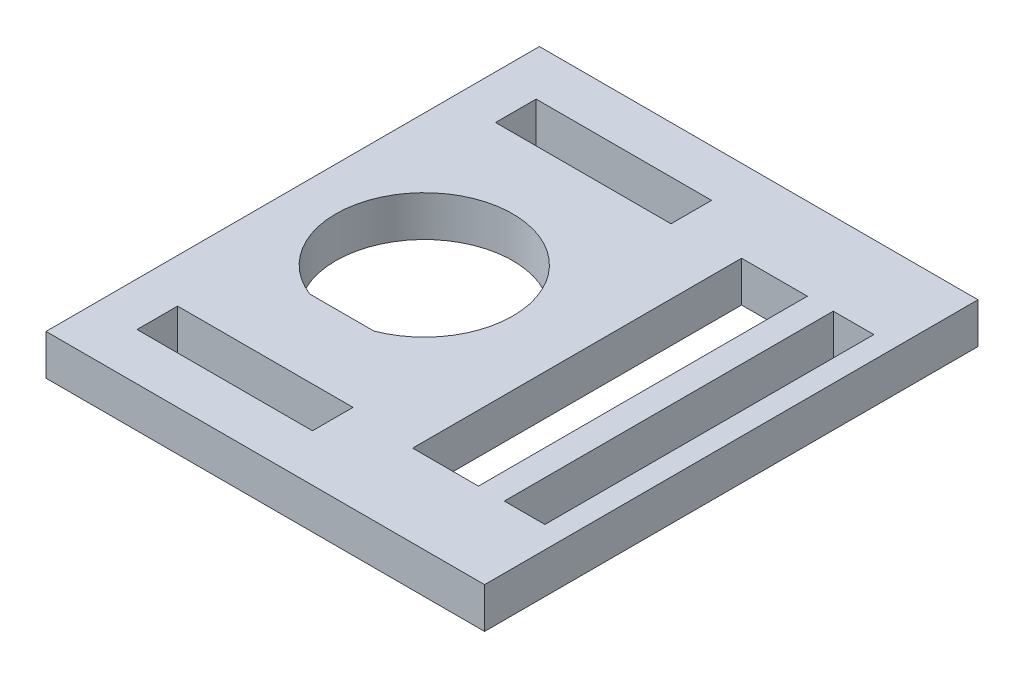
ISO-10303-21;
HEADER;
FILE_DESCRIPTION(('STEP AP214'),'2;1');
FILE_NAME('part.step','',(''),(''),'','','');
FILE_SCHEMA(('AUTOMOTIVE_DESIGN { 1 0 10303 214 1 1 1 1 }'));
ENDSEC;
DATA;
#1=APPLICATION_CONTEXT('core data for automotive mechanical design processes');
#2=APPLICATION_PROTOCOL_DEFINITION('international standard','automotive_design',2000,#1);
#3=PRODUCT_CONTEXT('',#1,'mechanical');
#4=PRODUCT('Part','Part','',(#3));
#5=PRODUCT_RELATED_PRODUCT_CATEGORY('part','',(#4));
#6=PRODUCT_DEFINITION_FORMATION('','',#4);
#7=PRODUCT_DEFINITION_CONTEXT('part definition',#1,'design');
#8=PRODUCT_DEFINITION('design','',#6,#7);
#9=PRODUCT_DEFINITION_SHAPE('','',#8);
#10=(LENGTH_UNIT() NAMED_UNIT(*) SI_UNIT(.MILLI.,.METRE.));
#11=(NAMED_UNIT(*) PLANE_ANGLE_UNIT() SI_UNIT($,.RADIAN.));
#12=(NAMED_UNIT(*) SI_UNIT($,.STERADIAN.) SOLID_ANGLE_UNIT());
#13=UNCERTAINTY_MEASURE_WITH_UNIT(LENGTH_MEASURE(1.E-05),#10,'distance_accuracy_value','');
#14=(GEOMETRIC_REPRESENTATION_CONTEXT(3) GLOBAL_UNCERTAINTY_ASSIGNED_CONTEXT((#13)) GLOBAL_UNIT_ASSIGNED_CONTEXT((#10,
#11,#12)) REPRESENTATION_CONTEXT('',''));
#15=CARTESIAN_POINT('',(0.,0.,0.));
#16=DIRECTION('',(0.,0.,1.));
#17=DIRECTION('',(1.,0.,0.));
#18=AXIS2_PLACEMENT_3D('',#15,#16,#17);
#19=CARTESIAN_POINT('',(0.,2.3495,0.));
#20=DIRECTION('',(0.,1.,0.));
#21=DIRECTION('',(0.,0.,1.));
#22=AXIS2_PLACEMENT_3D('',#19,#20,#21);
#23=PLANE('',#22);
#24=DIRECTION('',(0.,0.,-1.));
#25=VECTOR('',#24,1.);
#26=CARTESIAN_POINT('',(25.4,2.3495,-28.575));
#27=LINE('',#26,#25);
#28=CARTESIAN_POINT('',(25.4,2.3495,28.575));
#29=VERTEX_POINT('',#28);
#30=CARTESIAN_POINT('',(25.4,2.3495,-28.575));
#31=VERTEX_POINT('',#30);
#32=EDGE_CURVE('E329',#29,#31,#27,.T.);
#33=ORIENTED_EDGE('',*,*,#32,.T.);
#34=DIRECTION('',(-1.,0.,0.));
#35=VECTOR('',#34,1.);
#36=CARTESIAN_POINT('',(-25.4,2.3495,-28.575));
#37=LINE('',#36,#35);
#38=CARTESIAN_POINT('',(-25.4,2.3495,-28.575));
#39=VERTEX_POINT('',#38);
#40=EDGE_CURVE('E332',#31,#39,#37,.T.);
#41=ORIENTED_EDGE('',*,*,#40,.T.);
#42=DIRECTION('',(0.,0.,1.));
#43=VECTOR('',#42,1.);
#44=CARTESIAN_POINT('',(-25.4,2.3495,-28.575));
#45=LINE('',#44,#43);
#46=CARTESIAN_POINT('',(-25.4,2.3495,28.575));
#47=VERTEX_POINT('',#46);
#48=EDGE_CURVE('E335',#39,#47,#45,.T.);
#49=ORIENTED_EDGE('',*,*,#48,.T.);
#50=DIRECTION('',(1.,0.,0.));
#51=VECTOR('',#50,1.);
#52=CARTESIAN_POINT('',(-25.4,2.3495,28.575));
#53=LINE('',#52,#51);
#54=EDGE_CURVE('E337',#47,#29,#53,.T.);
#55=ORIENTED_EDGE('',*,*,#54,.T.);
#56=EDGE_LOOP('',(#33,#41,#49,#55));
#57=FACE_BOUND('',#56,.T.);
#58=CARTESIAN_POINT('',(-10.16,2.3495,0.));
#59=DIRECTION('',(0.,1.,0.));
#60=DIRECTION('',(0.,0.,1.));
#61=AXIS2_PLACEMENT_3D('',#58,#59,#60);
#62=CIRCLE('',#61,10.25);
#63=CARTESIAN_POINT('',(-6.43709790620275,2.3495,9.55));
#64=VERTEX_POINT('',#63);
#65=CARTESIAN_POINT('',(-13.8829020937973,2.3495,9.55));
#66=VERTEX_POINT('',#65);
#67=EDGE_CURVE('E306',#64,#66,#62,.T.);
#68=ORIENTED_EDGE('',*,*,#67,.F.);
#69=DIRECTION('',(1.,0.,0.));
#70=VECTOR('',#69,1.);
#71=CARTESIAN_POINT('',(-13.8829020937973,2.3495,9.55));
#72=LINE('',#71,#70);
#73=EDGE_CURVE('E317',#66,#64,#72,.T.);
#74=ORIENTED_EDGE('',*,*,#73,.F.);
#75=EDGE_LOOP('',(#68,#74));
#76=FACE_BOUND('',#75,.T.);
#77=DIRECTION('',(0.,0.,-1.));
#78=VECTOR('',#77,1.);
#79=CARTESIAN_POINT('',(18.161,2.3495,19.05));
#80=LINE('',#79,#78);
#81=CARTESIAN_POINT('',(18.161,2.3495,19.05));
#82=VERTEX_POINT('',#81);
#83=CARTESIAN_POINT('',(18.161,2.3495,-19.05));
#84=VERTEX_POINT('',#83);
#85=EDGE_CURVE('E281',#82,#84,#80,.T.);
#86=ORIENTED_EDGE('',*,*,#85,.T.);
#87=DIRECTION('',(1.,0.,0.));
#88=VECTOR('',#87,1.);
#89=CARTESIAN_POINT('',(22.86,2.3495,-19.05));
#90=LINE('',#89,#88);
#91=CARTESIAN_POINT('',(22.86,2.3495,-19.05));
#92=VERTEX_POINT('',#91);
#93=EDGE_CURVE('E284',#84,#92,#90,.T.);
#94=ORIENTED_EDGE('',*,*,#93,.T.);
#95=DIRECTION('',(0.,0.,1.));
#96=VECTOR('',#95,1.);
#97=CARTESIAN_POINT('',(22.86,2.3495,19.05));
#98=LINE('',#97,#96);
#99=CARTESIAN_POINT('',(22.86,2.3495,19.05));
#100=VERTEX_POINT('',#99);
#101=EDGE_CURVE('E288',#92,#100,#98,.T.);
#102=ORIENTED_EDGE('',*,*,#101,.T.);
#103=DIRECTION('',(-1.,0.,0.));
#104=VECTOR('',#103,1.);
#105=CARTESIAN_POINT('',(22.86,2.3495,19.05));
#106=LINE('',#105,#104);
#107=EDGE_CURVE('E291',#100,#82,#106,.T.);
#108=ORIENTED_EDGE('',*,*,#107,.T.);
#109=EDGE_LOOP('',(#86,#94,#102,#108));
#110=FACE_BOUND('',#109,.T.);
#111=DIRECTION('',(0.,0.,-1.));
#112=VECTOR('',#111,1.);
#113=CARTESIAN_POINT('',(15.161,2.3495,-19.05));
#114=LINE('',#113,#112);
#115=CARTESIAN_POINT('',(15.161,2.3495,19.05));
#116=VERTEX_POINT('',#115);
#117=CARTESIAN_POINT('',(15.161,2.3495,-19.05));
#118=VERTEX_POINT('',#117);
#119=EDGE_CURVE('E242',#116,#118,#114,.T.);
#120=ORIENTED_EDGE('',*,*,#119,.F.);
#121=DIRECTION('',(1.,0.,0.));
#122=VECTOR('',#121,1.);
#123=CARTESIAN_POINT('',(7.541,2.3495,19.05));
#124=LINE('',#123,#122);
#125=CARTESIAN_POINT('',(7.541,2.3495,19.05));
#126=VERTEX_POINT('',#125);
#127=EDGE_CURVE('E253',#126,#116,#124,.T.);
#128=ORIENTED_EDGE('',*,*,#127,.F.);
#129=DIRECTION('',(0.,0.,1.));
#130=VECTOR('',#129,1.);
#131=CARTESIAN_POINT('',(7.541,2.3495,-19.05));
#132=LINE('',#131,#130);
#133=CARTESIAN_POINT('',(7.541,2.3495,-19.05));
#134=VERTEX_POINT('',#133);
#135=EDGE_CURVE('E267',#134,#126,#132,.T.);
#136=ORIENTED_EDGE('',*,*,#135,.F.);
#137=DIRECTION('',(-1.,0.,0.));
#138=VECTOR('',#137,1.);
#139=CARTESIAN_POINT('',(7.541,2.3495,-19.05));
#140=LINE('',#139,#138);
#141=EDGE_CURVE('E264',#118,#134,#140,.T.);
#142=ORIENTED_EDGE('',*,*,#141,.F.);
#143=EDGE_LOOP('',(#120,#128,#136,#142));
#144=FACE_BOUND('',#143,.T.);
#145=DIRECTION('',(0.,0.,1.));
#146=VECTOR('',#145,1.);
#147=CARTESIAN_POINT('',(-20.32,2.3495,-23.114));
#148=LINE('',#147,#146);
#149=CARTESIAN_POINT('',(-20.32,2.3495,-23.114));
#150=VERTEX_POINT('',#149);
#151=CARTESIAN_POINT('',(-20.32,2.3495,-18.415));
#152=VERTEX_POINT('',#151);
#153=EDGE_CURVE('E213',#150,#152,#148,.T.);
#154=ORIENTED_EDGE('',*,*,#153,.F.);
#155=DIRECTION('',(-1.,0.,0.));
#156=VECTOR('',#155,1.);
#157=CARTESIAN_POINT('',(0.,2.3495,-23.114));
#158=LINE('',#157,#156);
#159=CARTESIAN_POINT('',(0.,2.3495,-23.114));
#160=VERTEX_POINT('',#159);
#161=EDGE_CURVE('E221',#160,#150,#158,.T.);
#162=ORIENTED_EDGE('',*,*,#161,.F.);
#163=DIRECTION('',(0.,0.,-1.));
#164=VECTOR('',#163,1.);
#165=CARTESIAN_POINT('',(0.,2.3495,-18.415));
#166=LINE('',#165,#164);
#167=CARTESIAN_POINT('',(0.,2.3495,-18.415));
#168=VERTEX_POINT('',#167);
#169=EDGE_CURVE('E235',#168,#160,#166,.T.);
#170=ORIENTED_EDGE('',*,*,#169,.F.);
#171=DIRECTION('',(1.,0.,0.));
#172=VECTOR('',#171,1.);
#173=CARTESIAN_POINT('',(-20.32,2.3495,-18.415));
#174=LINE('',#173,#172);
#175=EDGE_CURVE('E232',#152,#168,#174,.T.);
#176=ORIENTED_EDGE('',*,*,#175,.F.);
#177=EDGE_LOOP('',(#154,#162,#170,#176));
#178=FACE_BOUND('',#177,.T.);
#179=DIRECTION('',(-1.,0.,0.));
#180=VECTOR('',#179,1.);
#181=CARTESIAN_POINT('',(0.,2.3495,23.114));
#182=LINE('',#181,#180);
#183=CARTESIAN_POINT('',(0.,2.3495,23.114));
#184=VERTEX_POINT('',#183);
#185=CARTESIAN_POINT('',(-20.32,2.3495,23.114));
#186=VERTEX_POINT('',#185);
#187=EDGE_CURVE('E207',#184,#186,#182,.T.);
#188=ORIENTED_EDGE('',*,*,#187,.T.);
#189=DIRECTION('',(0.,0.,-1.));
#190=VECTOR('',#189,1.);
#191=CARTESIAN_POINT('',(-20.32,2.3495,23.114));
#192=LINE('',#191,#190);
#193=CARTESIAN_POINT('',(-20.32,2.3495,18.415));
#194=VERTEX_POINT('',#193);
#195=EDGE_CURVE('E48',#186,#194,#192,.T.);
#196=ORIENTED_EDGE('',*,*,#195,.T.);
#197=DIRECTION('',(1.,0.,0.));
#198=VECTOR('',#197,1.);
#199=CARTESIAN_POINT('',(-20.32,2.3495,18.415));
#200=LINE('',#199,#198);
#201=CARTESIAN_POINT('',(0.,2.3495,18.415));
#202=VERTEX_POINT('',#201);
#203=EDGE_CURVE('E198',#194,#202,#200,.T.);
#204=ORIENTED_EDGE('',*,*,#203,.T.);
#205=DIRECTION('',(0.,0.,1.));
#206=VECTOR('',#205,1.);
#207=CARTESIAN_POINT('',(0.,2.3495,18.415));
#208=LINE('',#207,#206);
#209=EDGE_CURVE('E201',#202,#184,#208,.T.);
#210=ORIENTED_EDGE('',*,*,#209,.T.);
#211=EDGE_LOOP('',(#188,#196,#204,#210));
#212=FACE_BOUND('',#211,.T.);
#213=ADVANCED_FACE('F33',(#57,#76,#110,#144,#178,#212),#23,.T.);
#214=CARTESIAN_POINT('',(0.,-2.3495,0.));
#215=DIRECTION('',(0.,1.,0.));
#216=DIRECTION('',(0.,0.,1.));
#217=AXIS2_PLACEMENT_3D('',#214,#215,#216);
#218=PLANE('',#217);
#219=DIRECTION('',(0.,0.,-1.));
#220=VECTOR('',#219,1.);
#221=CARTESIAN_POINT('',(25.4,-2.3495,-28.575));
#222=LINE('',#221,#220);
#223=CARTESIAN_POINT('',(25.4,-2.3495,28.575));
#224=VERTEX_POINT('',#223);
#225=CARTESIAN_POINT('',(25.4,-2.3495,-28.575));
#226=VERTEX_POINT('',#225);
#227=EDGE_CURVE('E326',#224,#226,#222,.T.);
#228=ORIENTED_EDGE('',*,*,#227,.F.);
#229=DIRECTION('',(1.,0.,0.));
#230=VECTOR('',#229,1.);
#231=CARTESIAN_POINT('',(-25.4,-2.3495,28.575));
#232=LINE('',#231,#230);
#233=CARTESIAN_POINT('',(-25.4,-2.3495,28.575));
#234=VERTEX_POINT('',#233);
#235=EDGE_CURVE('E333',#234,#224,#232,.T.);
#236=ORIENTED_EDGE('',*,*,#235,.F.);
#237=DIRECTION('',(0.,0.,1.));
#238=VECTOR('',#237,1.);
#239=CARTESIAN_POINT('',(-25.4,-2.3495,-28.575));
#240=LINE('',#239,#238);
#241=CARTESIAN_POINT('',(-25.4,-2.3495,-28.575));
#242=VERTEX_POINT('',#241);
#243=EDGE_CURVE('E344',#242,#234,#240,.T.);
#244=ORIENTED_EDGE('',*,*,#243,.F.);
#245=DIRECTION('',(-1.,0.,0.));
#246=VECTOR('',#245,1.);
#247=CARTESIAN_POINT('',(-25.4,-2.3495,-28.575));
#248=LINE('',#247,#246);
#249=EDGE_CURVE('E342',#226,#242,#248,.T.);
#250=ORIENTED_EDGE('',*,*,#249,.F.);
#251=EDGE_LOOP('',(#228,#236,#244,#250));
#252=FACE_BOUND('',#251,.T.);
#253=DIRECTION('',(1.,0.,0.));
#254=VECTOR('',#253,1.);
#255=CARTESIAN_POINT('',(-13.8829020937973,-2.3495,9.55));
#256=LINE('',#255,#254);
#257=CARTESIAN_POINT('',(-13.8829020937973,-2.3495,9.55));
#258=VERTEX_POINT('',#257);
#259=CARTESIAN_POINT('',(-6.43709790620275,-2.3495,9.55));
#260=VERTEX_POINT('',#259);
#261=EDGE_CURVE('E316',#258,#260,#256,.T.);
#262=ORIENTED_EDGE('',*,*,#261,.T.);
#263=CARTESIAN_POINT('',(-10.16,-2.3495,0.));
#264=DIRECTION('',(0.,1.,0.));
#265=DIRECTION('',(0.,0.,1.));
#266=AXIS2_PLACEMENT_3D('',#263,#264,#265);
#267=CIRCLE('',#266,10.25);
#268=EDGE_CURVE('E313',#260,#258,#267,.T.);
#269=ORIENTED_EDGE('',*,*,#268,.T.);
#270=EDGE_LOOP('',(#262,#269));
#271=FACE_BOUND('',#270,.T.);
#272=DIRECTION('',(1.,0.,0.));
#273=VECTOR('',#272,1.);
#274=CARTESIAN_POINT('',(22.86,-2.3495,-19.05));
#275=LINE('',#274,#273);
#276=CARTESIAN_POINT('',(18.161,-2.3495,-19.05));
#277=VERTEX_POINT('',#276);
#278=CARTESIAN_POINT('',(22.86,-2.3495,-19.05));
#279=VERTEX_POINT('',#278);
#280=EDGE_CURVE('E296',#277,#279,#275,.T.);
#281=ORIENTED_EDGE('',*,*,#280,.F.);
#282=DIRECTION('',(0.,0.,-1.));
#283=VECTOR('',#282,1.);
#284=CARTESIAN_POINT('',(18.161,-2.3495,19.05));
#285=LINE('',#284,#283);
#286=CARTESIAN_POINT('',(18.161,-2.3495,19.05));
#287=VERTEX_POINT('',#286);
#288=EDGE_CURVE('E274',#287,#277,#285,.T.);
#289=ORIENTED_EDGE('',*,*,#288,.F.);
#290=DIRECTION('',(-1.,0.,0.));
#291=VECTOR('',#290,1.);
#292=CARTESIAN_POINT('',(22.86,-2.3495,19.05));
#293=LINE('',#292,#291);
#294=CARTESIAN_POINT('',(22.86,-2.3495,19.05));
#295=VERTEX_POINT('',#294);
#296=EDGE_CURVE('E285',#295,#287,#293,.T.);
#297=ORIENTED_EDGE('',*,*,#296,.F.);
#298=DIRECTION('',(0.,0.,1.));
#299=VECTOR('',#298,1.);
#300=CARTESIAN_POINT('',(22.86,-2.3495,19.05));
#301=LINE('',#300,#299);
#302=EDGE_CURVE('E299',#279,#295,#301,.T.);
#303=ORIENTED_EDGE('',*,*,#302,.F.);
#304=EDGE_LOOP('',(#281,#289,#297,#303));
#305=FACE_BOUND('',#304,.T.);
#306=DIRECTION('',(1.,0.,0.));
#307=VECTOR('',#306,1.);
#308=CARTESIAN_POINT('',(7.541,-2.3495,19.05));
#309=LINE('',#308,#307);
#310=CARTESIAN_POINT('',(7.541,-2.3495,19.05));
#311=VERTEX_POINT('',#310);
#312=CARTESIAN_POINT('',(15.161,-2.3495,19.05));
#313=VERTEX_POINT('',#312);
#314=EDGE_CURVE('E259',#311,#313,#309,.T.);
#315=ORIENTED_EDGE('',*,*,#314,.T.);
#316=DIRECTION('',(0.,0.,-1.));
#317=VECTOR('',#316,1.);
#318=CARTESIAN_POINT('',(15.161,-2.3495,-19.05));
#319=LINE('',#318,#317);
#320=CARTESIAN_POINT('',(15.161,-2.3495,-19.05));
#321=VERTEX_POINT('',#320);
#322=EDGE_CURVE('E249',#313,#321,#319,.T.);
#323=ORIENTED_EDGE('',*,*,#322,.T.);
#324=DIRECTION('',(-1.,0.,0.));
#325=VECTOR('',#324,1.);
#326=CARTESIAN_POINT('',(7.541,-2.3495,-19.05));
#327=LINE('',#326,#325);
#328=CARTESIAN_POINT('',(7.541,-2.3495,-19.05));
#329=VERTEX_POINT('',#328);
#330=EDGE_CURVE('E252',#321,#329,#327,.T.);
#331=ORIENTED_EDGE('',*,*,#330,.T.);
#332=DIRECTION('',(0.,0.,1.));
#333=VECTOR('',#332,1.);
#334=CARTESIAN_POINT('',(7.541,-2.3495,-19.05));
#335=LINE('',#334,#333);
#336=EDGE_CURVE('E256',#329,#311,#335,.T.);
#337=ORIENTED_EDGE('',*,*,#336,.T.);
#338=EDGE_LOOP('',(#315,#323,#331,#337));
#339=FACE_BOUND('',#338,.T.);
#340=DIRECTION('',(-1.,0.,0.));
#341=VECTOR('',#340,1.);
#342=CARTESIAN_POINT('',(0.,-2.3495,-23.114));
#343=LINE('',#342,#341);
#344=CARTESIAN_POINT('',(0.,-2.3495,-23.114));
#345=VERTEX_POINT('',#344);
#346=CARTESIAN_POINT('',(-20.32,-2.3495,-23.114));
#347=VERTEX_POINT('',#346);
#348=EDGE_CURVE('E227',#345,#347,#343,.T.);
#349=ORIENTED_EDGE('',*,*,#348,.T.);
#350=DIRECTION('',(0.,0.,1.));
#351=VECTOR('',#350,1.);
#352=CARTESIAN_POINT('',(-20.32,-2.3495,-23.114));
#353=LINE('',#352,#351);
#354=CARTESIAN_POINT('',(-20.32,-2.3495,-18.415));
#355=VERTEX_POINT('',#354);
#356=EDGE_CURVE('E217',#347,#355,#353,.T.);
#357=ORIENTED_EDGE('',*,*,#356,.T.);
#358=DIRECTION('',(1.,0.,0.));
#359=VECTOR('',#358,1.);
#360=CARTESIAN_POINT('',(-20.32,-2.3495,-18.415));
#361=LINE('',#360,#359);
#362=CARTESIAN_POINT('',(0.,-2.3495,-18.415));
#363=VERTEX_POINT('',#362);
#364=EDGE_CURVE('E220',#355,#363,#361,.T.);
#365=ORIENTED_EDGE('',*,*,#364,.T.);
#366=DIRECTION('',(0.,0.,-1.));
#367=VECTOR('',#366,1.);
#368=CARTESIAN_POINT('',(0.,-2.3495,-18.415));
#369=LINE('',#368,#367);
#370=EDGE_CURVE('E224',#363,#345,#369,.T.);
#371=ORIENTED_EDGE('',*,*,#370,.T.);
#372=EDGE_LOOP('',(#349,#357,#365,#371));
#373=FACE_BOUND('',#372,.T.);
#374=DIRECTION('',(0.,0.,-1.));
#375=VECTOR('',#374,1.);
#376=CARTESIAN_POINT('',(-20.32,-2.3495,23.114));
#377=LINE('',#376,#375);
#378=CARTESIAN_POINT('',(-20.32,-2.3495,23.114));
#379=VERTEX_POINT('',#378);
#380=CARTESIAN_POINT('',(-20.32,-2.3495,18.415));
#381=VERTEX_POINT('',#380);
#382=EDGE_CURVE('E190',#379,#381,#377,.T.);
#383=ORIENTED_EDGE('',*,*,#382,.F.);
#384=DIRECTION('',(-1.,0.,0.));
#385=VECTOR('',#384,1.);
#386=CARTESIAN_POINT('',(0.,-2.3495,23.114));
#387=LINE('',#386,#385);
#388=CARTESIAN_POINT('',(0.,-2.3495,23.114));
#389=VERTEX_POINT('',#388);
#390=EDGE_CURVE('E182',#389,#379,#387,.T.);
#391=ORIENTED_EDGE('',*,*,#390,.F.);
#392=DIRECTION('',(0.,0.,1.));
#393=VECTOR('',#392,1.);
#394=CARTESIAN_POINT('',(0.,-2.3495,18.415));
#395=LINE('',#394,#393);
#396=CARTESIAN_POINT('',(0.,-2.3495,18.415));
#397=VERTEX_POINT('',#396);
#398=EDGE_CURVE('E189',#397,#389,#395,.T.);
#399=ORIENTED_EDGE('',*,*,#398,.F.);
#400=DIRECTION('',(1.,0.,0.));
#401=VECTOR('',#400,1.);
#402=CARTESIAN_POINT('',(-20.32,-2.3495,18.415));
#403=LINE('',#402,#401);
#404=EDGE_CURVE('E194',#381,#397,#403,.T.);
#405=ORIENTED_EDGE('',*,*,#404,.F.);
#406=EDGE_LOOP('',(#383,#391,#399,#405));
#407=FACE_BOUND('',#406,.T.);
#408=ADVANCED_FACE('F197',(#252,#271,#305,#339,#373,#407),#218,.F.);
#409=CARTESIAN_POINT('',(25.4,2.3495,-28.575));
#410=DIRECTION('',(-1.,0.,0.));
#411=DIRECTION('',(0.,0.,1.));
#412=AXIS2_PLACEMENT_3D('',#409,#410,#411);
#413=PLANE('',#412);
#414=ORIENTED_EDGE('',*,*,#227,.T.);
#415=DIRECTION('',(0.,-1.,0.));
#416=VECTOR('',#415,1.);
#417=CARTESIAN_POINT('',(25.4,2.3495,-28.575));
#418=LINE('',#417,#416);
#419=EDGE_CURVE('E11',#31,#226,#418,.T.);
#420=ORIENTED_EDGE('',*,*,#419,.F.);
#421=ORIENTED_EDGE('',*,*,#32,.F.);
#422=DIRECTION('',(0.,-1.,0.));
#423=VECTOR('',#422,1.);
#424=CARTESIAN_POINT('',(25.4,2.3495,28.575));
#425=LINE('',#424,#423);
#426=EDGE_CURVE('E339',#29,#224,#425,.T.);
#427=ORIENTED_EDGE('',*,*,#426,.T.);
#428=EDGE_LOOP('',(#414,#420,#421,#427));
#429=FACE_BOUND('',#428,.T.);
#430=ADVANCED_FACE('F35',(#429),#413,.F.);
#431=CARTESIAN_POINT('',(-25.4,2.3495,-28.575));
#432=DIRECTION('',(0.,0.,1.));
#433=DIRECTION('',(1.,0.,0.));
#434=AXIS2_PLACEMENT_3D('',#431,#432,#433);
#435=PLANE('',#434);
#436=ORIENTED_EDGE('',*,*,#249,.T.);
#437=DIRECTION('',(0.,-1.,0.));
#438=VECTOR('',#437,1.);
#439=CARTESIAN_POINT('',(-25.4,2.3495,-28.575));
#440=LINE('',#439,#438);
#441=EDGE_CURVE('E41',#39,#242,#440,.T.);
#442=ORIENTED_EDGE('',*,*,#441,.F.);
#443=ORIENTED_EDGE('',*,*,#40,.F.);
#444=ORIENTED_EDGE('',*,*,#419,.T.);
#445=EDGE_LOOP('',(#436,#442,#443,#444));
#446=FACE_BOUND('',#445,.T.);
#447=ADVANCED_FACE('F372',(#446),#435,.F.);
#448=CARTESIAN_POINT('',(-25.4,2.3495,-28.575));
#449=DIRECTION('',(1.,0.,0.));
#450=DIRECTION('',(0.,0.,-1.));
#451=AXIS2_PLACEMENT_3D('',#448,#449,#450);
#452=PLANE('',#451);
#453=ORIENTED_EDGE('',*,*,#243,.T.);
#454=DIRECTION('',(0.,-1.,0.));
#455=VECTOR('',#454,1.);
#456=CARTESIAN_POINT('',(-25.4,2.3495,28.575));
#457=LINE('',#456,#455);
#458=EDGE_CURVE('E349',#47,#234,#457,.T.);
#459=ORIENTED_EDGE('',*,*,#458,.F.);
#460=ORIENTED_EDGE('',*,*,#48,.F.);
#461=ORIENTED_EDGE('',*,*,#441,.T.);
#462=EDGE_LOOP('',(#453,#459,#460,#461));
#463=FACE_BOUND('',#462,.T.);
#464=ADVANCED_FACE('F356',(#463),#452,.F.);
#465=CARTESIAN_POINT('',(-25.4,2.3495,28.575));
#466=DIRECTION('',(0.,0.,-1.));
#467=DIRECTION('',(-1.,0.,0.));
#468=AXIS2_PLACEMENT_3D('',#465,#466,#467);
#469=PLANE('',#468);
#470=ORIENTED_EDGE('',*,*,#235,.T.);
#471=ORIENTED_EDGE('',*,*,#426,.F.);
#472=ORIENTED_EDGE('',*,*,#54,.F.);
#473=ORIENTED_EDGE('',*,*,#458,.T.);
#474=EDGE_LOOP('',(#470,#471,#472,#473));
#475=FACE_BOUND('',#474,.T.);
#476=ADVANCED_FACE('F365',(#475),#469,.F.);
#477=CARTESIAN_POINT('',(-10.16,-2.3495,0.));
#478=DIRECTION('',(0.,1.,0.));
#479=DIRECTION('',(0.,0.,1.));
#480=AXIS2_PLACEMENT_3D('',#477,#478,#479);
#481=CYLINDRICAL_SURFACE('',#480,10.25);
#482=ORIENTED_EDGE('',*,*,#67,.T.);
#483=DIRECTION('',(0.,1.,0.));
#484=VECTOR('',#483,1.);
#485=CARTESIAN_POINT('',(-13.8829020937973,-2.3495,9.55));
#486=LINE('',#485,#484);
#487=EDGE_CURVE('E320',#258,#66,#486,.T.);
#488=ORIENTED_EDGE('',*,*,#487,.F.);
#489=ORIENTED_EDGE('',*,*,#268,.F.);
#490=DIRECTION('',(0.,1.,0.));
#491=VECTOR('',#490,1.);
#492=CARTESIAN_POINT('',(-6.43709790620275,-2.3495,9.55));
#493=LINE('',#492,#491);
#494=EDGE_CURVE('E324',#260,#64,#493,.T.);
#495=ORIENTED_EDGE('',*,*,#494,.T.);
#496=EDGE_LOOP('',(#482,#488,#489,#495));
#497=FACE_BOUND('',#496,.T.);
#498=ADVANCED_FACE('F386',(#497),#481,.F.);
#499=CARTESIAN_POINT('',(-13.8829020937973,-2.3495,9.55));
#500=DIRECTION('',(0.,0.,1.));
#501=DIRECTION('',(1.,0.,0.));
#502=AXIS2_PLACEMENT_3D('',#499,#500,#501);
#503=PLANE('',#502);
#504=ORIENTED_EDGE('',*,*,#73,.T.);
#505=ORIENTED_EDGE('',*,*,#494,.F.);
#506=ORIENTED_EDGE('',*,*,#261,.F.);
#507=ORIENTED_EDGE('',*,*,#487,.T.);
#508=EDGE_LOOP('',(#504,#505,#506,#507));
#509=FACE_BOUND('',#508,.T.);
#510=ADVANCED_FACE('F393',(#509),#503,.F.);
#511=CARTESIAN_POINT('',(18.161,2.3495,19.05));
#512=DIRECTION('',(-1.,0.,0.));
#513=DIRECTION('',(0.,0.,1.));
#514=AXIS2_PLACEMENT_3D('',#511,#512,#513);
#515=PLANE('',#514);
#516=ORIENTED_EDGE('',*,*,#288,.T.);
#517=DIRECTION('',(0.,-1.,0.));
#518=VECTOR('',#517,1.);
#519=CARTESIAN_POINT('',(18.161,2.3495,-19.05));
#520=LINE('',#519,#518);
#521=EDGE_CURVE('E294',#84,#277,#520,.T.);
#522=ORIENTED_EDGE('',*,*,#521,.F.);
#523=ORIENTED_EDGE('',*,*,#85,.F.);
#524=DIRECTION('',(0.,-1.,0.));
#525=VECTOR('',#524,1.);
#526=CARTESIAN_POINT('',(18.161,2.3495,19.05));
#527=LINE('',#526,#525);
#528=EDGE_CURVE('E304',#82,#287,#527,.T.);
#529=ORIENTED_EDGE('',*,*,#528,.T.);
#530=EDGE_LOOP('',(#516,#522,#523,#529));
#531=FACE_BOUND('',#530,.T.);
#532=ADVANCED_FACE('F398',(#531),#515,.F.);
#533=CARTESIAN_POINT('',(22.86,2.3495,19.05));
#534=DIRECTION('',(0.,0.,1.));
#535=DIRECTION('',(1.,0.,0.));
#536=AXIS2_PLACEMENT_3D('',#533,#534,#535);
#537=PLANE('',#536);
#538=ORIENTED_EDGE('',*,*,#296,.T.);
#539=ORIENTED_EDGE('',*,*,#528,.F.);
#540=ORIENTED_EDGE('',*,*,#107,.F.);
#541=DIRECTION('',(0.,-1.,0.));
#542=VECTOR('',#541,1.);
#543=CARTESIAN_POINT('',(22.86,2.3495,19.05));
#544=LINE('',#543,#542);
#545=EDGE_CURVE('E307',#100,#295,#544,.T.);
#546=ORIENTED_EDGE('',*,*,#545,.T.);
#547=EDGE_LOOP('',(#538,#539,#540,#546));
#548=FACE_BOUND('',#547,.T.);
#549=ADVANCED_FACE('F465',(#548),#537,.F.);
#550=CARTESIAN_POINT('',(22.86,2.3495,19.05));
#551=DIRECTION('',(1.,0.,0.));
#552=DIRECTION('',(0.,0.,-1.));
#553=AXIS2_PLACEMENT_3D('',#550,#551,#552);
#554=PLANE('',#553);
#555=ORIENTED_EDGE('',*,*,#302,.T.);
#556=ORIENTED_EDGE('',*,*,#545,.F.);
#557=ORIENTED_EDGE('',*,*,#101,.F.);
#558=DIRECTION('',(0.,-1.,0.));
#559=VECTOR('',#558,1.);
#560=CARTESIAN_POINT('',(22.86,2.3495,-19.05));
#561=LINE('',#560,#559);
#562=EDGE_CURVE('E309',#92,#279,#561,.T.);
#563=ORIENTED_EDGE('',*,*,#562,.T.);
#564=EDGE_LOOP('',(#555,#556,#557,#563));
#565=FACE_BOUND('',#564,.T.);
#566=ADVANCED_FACE('F468',(#565),#554,.F.);
#567=CARTESIAN_POINT('',(22.86,2.3495,-19.05));
#568=DIRECTION('',(0.,0.,-1.));
#569=DIRECTION('',(-1.,0.,0.));
#570=AXIS2_PLACEMENT_3D('',#567,#568,#569);
#571=PLANE('',#570);
#572=ORIENTED_EDGE('',*,*,#280,.T.);
#573=ORIENTED_EDGE('',*,*,#562,.F.);
#574=ORIENTED_EDGE('',*,*,#93,.F.);
#575=ORIENTED_EDGE('',*,*,#521,.T.);
#576=EDGE_LOOP('',(#572,#573,#574,#575));
#577=FACE_BOUND('',#576,.T.);
#578=ADVANCED_FACE('F463',(#577),#571,.F.);
#579=CARTESIAN_POINT('',(15.161,-2.3495,-19.05));
#580=DIRECTION('',(1.,0.,0.));
#581=DIRECTION('',(0.,0.,-1.));
#582=AXIS2_PLACEMENT_3D('',#579,#580,#581);
#583=PLANE('',#582);
#584=ORIENTED_EDGE('',*,*,#119,.T.);
#585=DIRECTION('',(0.,1.,0.));
#586=VECTOR('',#585,1.);
#587=CARTESIAN_POINT('',(15.161,-2.3495,-19.05));
#588=LINE('',#587,#586);
#589=EDGE_CURVE('E262',#321,#118,#588,.T.);
#590=ORIENTED_EDGE('',*,*,#589,.F.);
#591=ORIENTED_EDGE('',*,*,#322,.F.);
#592=DIRECTION('',(0.,1.,0.));
#593=VECTOR('',#592,1.);
#594=CARTESIAN_POINT('',(15.161,-2.3495,19.05));
#595=LINE('',#594,#593);
#596=EDGE_CURVE('E272',#313,#116,#595,.T.);
#597=ORIENTED_EDGE('',*,*,#596,.T.);
#598=EDGE_LOOP('',(#584,#590,#591,#597));
#599=FACE_BOUND('',#598,.T.);
#600=ADVANCED_FACE('F453',(#599),#583,.F.);
#601=CARTESIAN_POINT('',(7.541,-2.3495,19.05));
#602=DIRECTION('',(0.,0.,1.));
#603=DIRECTION('',(1.,0.,0.));
#604=AXIS2_PLACEMENT_3D('',#601,#602,#603);
#605=PLANE('',#604);
#606=ORIENTED_EDGE('',*,*,#127,.T.);
#607=ORIENTED_EDGE('',*,*,#596,.F.);
#608=ORIENTED_EDGE('',*,*,#314,.F.);
#609=DIRECTION('',(0.,1.,0.));
#610=VECTOR('',#609,1.);
#611=CARTESIAN_POINT('',(7.541,-2.3495,19.05));
#612=LINE('',#611,#610);
#613=EDGE_CURVE('E275',#311,#126,#612,.T.);
#614=ORIENTED_EDGE('',*,*,#613,.T.);
#615=EDGE_LOOP('',(#606,#607,#608,#614));
#616=FACE_BOUND('',#615,.T.);
#617=ADVANCED_FACE('F449',(#616),#605,.F.);
#618=CARTESIAN_POINT('',(7.541,-2.3495,-19.05));
#619=DIRECTION('',(-1.,0.,0.));
#620=DIRECTION('',(0.,0.,1.));
#621=AXIS2_PLACEMENT_3D('',#618,#619,#620);
#622=PLANE('',#621);
#623=ORIENTED_EDGE('',*,*,#135,.T.);
#624=ORIENTED_EDGE('',*,*,#613,.F.);
#625=ORIENTED_EDGE('',*,*,#336,.F.);
#626=DIRECTION('',(0.,1.,0.));
#627=VECTOR('',#626,1.);
#628=CARTESIAN_POINT('',(7.541,-2.3495,-19.05));
#629=LINE('',#628,#627);
#630=EDGE_CURVE('E277',#329,#134,#629,.T.);
#631=ORIENTED_EDGE('',*,*,#630,.T.);
#632=EDGE_LOOP('',(#623,#624,#625,#631));
#633=FACE_BOUND('',#632,.T.);
#634=ADVANCED_FACE('F452',(#633),#622,.F.);
#635=CARTESIAN_POINT('',(7.541,-2.3495,-19.05));
#636=DIRECTION('',(0.,0.,-1.));
#637=DIRECTION('',(-1.,0.,0.));
#638=AXIS2_PLACEMENT_3D('',#635,#636,#637);
#639=PLANE('',#638);
#640=ORIENTED_EDGE('',*,*,#141,.T.);
#641=ORIENTED_EDGE('',*,*,#630,.F.);
#642=ORIENTED_EDGE('',*,*,#330,.F.);
#643=ORIENTED_EDGE('',*,*,#589,.T.);
#644=EDGE_LOOP('',(#640,#641,#642,#643));
#645=FACE_BOUND('',#644,.T.);
#646=ADVANCED_FACE('F447',(#645),#639,.F.);
#647=CARTESIAN_POINT('',(-20.32,-2.3495,-23.114));
#648=DIRECTION('',(-1.,0.,0.));
#649=DIRECTION('',(0.,0.,1.));
#650=AXIS2_PLACEMENT_3D('',#647,#648,#649);
#651=PLANE('',#650);
#652=ORIENTED_EDGE('',*,*,#153,.T.);
#653=DIRECTION('',(0.,1.,0.));
#654=VECTOR('',#653,1.);
#655=CARTESIAN_POINT('',(-20.32,-2.3495,-18.415));
#656=LINE('',#655,#654);
#657=EDGE_CURVE('E230',#355,#152,#656,.T.);
#658=ORIENTED_EDGE('',*,*,#657,.F.);
#659=ORIENTED_EDGE('',*,*,#356,.F.);
#660=DIRECTION('',(0.,1.,0.));
#661=VECTOR('',#660,1.);
#662=CARTESIAN_POINT('',(-20.32,-2.3495,-23.114));
#663=LINE('',#662,#661);
#664=EDGE_CURVE('E240',#347,#150,#663,.T.);
#665=ORIENTED_EDGE('',*,*,#664,.T.);
#666=EDGE_LOOP('',(#652,#658,#659,#665));
#667=FACE_BOUND('',#666,.T.);
#668=ADVANCED_FACE('F437',(#667),#651,.F.);
#669=CARTESIAN_POINT('',(0.,-2.3495,-23.114));
#670=DIRECTION('',(0.,0.,-1.));
#671=DIRECTION('',(-1.,0.,0.));
#672=AXIS2_PLACEMENT_3D('',#669,#670,#671);
#673=PLANE('',#672);
#674=ORIENTED_EDGE('',*,*,#161,.T.);
#675=ORIENTED_EDGE('',*,*,#664,.F.);
#676=ORIENTED_EDGE('',*,*,#348,.F.);
#677=DIRECTION('',(0.,1.,0.));
#678=VECTOR('',#677,1.);
#679=CARTESIAN_POINT('',(0.,-2.3495,-23.114));
#680=LINE('',#679,#678);
#681=EDGE_CURVE('E243',#345,#160,#680,.T.);
#682=ORIENTED_EDGE('',*,*,#681,.T.);
#683=EDGE_LOOP('',(#674,#675,#676,#682));
#684=FACE_BOUND('',#683,.T.);
#685=ADVANCED_FACE('F433',(#684),#673,.F.);
#686=CARTESIAN_POINT('',(0.,-2.3495,-18.415));
#687=DIRECTION('',(1.,0.,0.));
#688=DIRECTION('',(0.,0.,-1.));
#689=AXIS2_PLACEMENT_3D('',#686,#687,#688);
#690=PLANE('',#689);
#691=ORIENTED_EDGE('',*,*,#169,.T.);
#692=ORIENTED_EDGE('',*,*,#681,.F.);
#693=ORIENTED_EDGE('',*,*,#370,.F.);
#694=DIRECTION('',(0.,1.,0.));
#695=VECTOR('',#694,1.);
#696=CARTESIAN_POINT('',(0.,-2.3495,-18.415));
#697=LINE('',#696,#695);
#698=EDGE_CURVE('E245',#363,#168,#697,.T.);
#699=ORIENTED_EDGE('',*,*,#698,.T.);
#700=EDGE_LOOP('',(#691,#692,#693,#699));
#701=FACE_BOUND('',#700,.T.);
#702=ADVANCED_FACE('F436',(#701),#690,.F.);
#703=CARTESIAN_POINT('',(-20.32,-2.3495,-18.415));
#704=DIRECTION('',(0.,0.,1.));
#705=DIRECTION('',(1.,0.,0.));
#706=AXIS2_PLACEMENT_3D('',#703,#704,#705);
#707=PLANE('',#706);
#708=ORIENTED_EDGE('',*,*,#175,.T.);
#709=ORIENTED_EDGE('',*,*,#698,.F.);
#710=ORIENTED_EDGE('',*,*,#364,.F.);
#711=ORIENTED_EDGE('',*,*,#657,.T.);
#712=EDGE_LOOP('',(#708,#709,#710,#711));
#713=FACE_BOUND('',#712,.T.);
#714=ADVANCED_FACE('F428',(#713),#707,.F.);
#715=CARTESIAN_POINT('',(-20.32,-2.3495,23.114));
#716=DIRECTION('',(1.,0.,0.));
#717=DIRECTION('',(0.,0.,-1.));
#718=AXIS2_PLACEMENT_3D('',#715,#716,#717);
#719=PLANE('',#718);
#720=ORIENTED_EDGE('',*,*,#195,.F.);
#721=DIRECTION('',(0.,1.,0.));
#722=VECTOR('',#721,1.);
#723=CARTESIAN_POINT('',(-20.32,-2.3495,23.114));
#724=LINE('',#723,#722);
#725=EDGE_CURVE('E184',#379,#186,#724,.T.);
#726=ORIENTED_EDGE('',*,*,#725,.F.);
#727=ORIENTED_EDGE('',*,*,#382,.T.);
#728=DIRECTION('',(0.,1.,0.));
#729=VECTOR('',#728,1.);
#730=CARTESIAN_POINT('',(-20.32,-2.3495,18.415));
#731=LINE('',#730,#729);
#732=EDGE_CURVE('E211',#381,#194,#731,.T.);
#733=ORIENTED_EDGE('',*,*,#732,.T.);
#734=EDGE_LOOP('',(#720,#726,#727,#733));
#735=FACE_BOUND('',#734,.T.);
#736=ADVANCED_FACE('F192',(#735),#719,.T.);
#737=CARTESIAN_POINT('',(-20.32,-2.3495,18.415));
#738=DIRECTION('',(0.,0.,1.));
#739=DIRECTION('',(1.,0.,0.));
#740=AXIS2_PLACEMENT_3D('',#737,#738,#739);
#741=PLANE('',#740);
#742=ORIENTED_EDGE('',*,*,#203,.F.);
#743=ORIENTED_EDGE('',*,*,#732,.F.);
#744=ORIENTED_EDGE('',*,*,#404,.T.);
#745=DIRECTION('',(0.,1.,0.));
#746=VECTOR('',#745,1.);
#747=CARTESIAN_POINT('',(0.,-2.3495,18.415));
#748=LINE('',#747,#746);
#749=EDGE_CURVE('E214',#397,#202,#748,.T.);
#750=ORIENTED_EDGE('',*,*,#749,.T.);
#751=EDGE_LOOP('',(#742,#743,#744,#750));
#752=FACE_BOUND('',#751,.T.);
#753=ADVANCED_FACE('F420',(#752),#741,.T.);
#754=CARTESIAN_POINT('',(0.,-2.3495,18.415));
#755=DIRECTION('',(-1.,0.,0.));
#756=DIRECTION('',(0.,0.,1.));
#757=AXIS2_PLACEMENT_3D('',#754,#755,#756);
#758=PLANE('',#757);
#759=ORIENTED_EDGE('',*,*,#209,.F.);
#760=ORIENTED_EDGE('',*,*,#749,.F.);
#761=ORIENTED_EDGE('',*,*,#398,.T.);
#762=DIRECTION('',(0.,1.,0.));
#763=VECTOR('',#762,1.);
#764=CARTESIAN_POINT('',(0.,-2.3495,23.114));
#765=LINE('',#764,#763);
#766=EDGE_CURVE('E56',#389,#184,#765,.T.);
#767=ORIENTED_EDGE('',*,*,#766,.T.);
#768=EDGE_LOOP('',(#759,#760,#761,#767));
#769=FACE_BOUND('',#768,.T.);
#770=ADVANCED_FACE('F418',(#769),#758,.T.);
#771=CARTESIAN_POINT('',(0.,-2.3495,23.114));
#772=DIRECTION('',(0.,0.,-1.));
#773=DIRECTION('',(-1.,0.,0.));
#774=AXIS2_PLACEMENT_3D('',#771,#772,#773);
#775=PLANE('',#774);
#776=ORIENTED_EDGE('',*,*,#187,.F.);
#777=ORIENTED_EDGE('',*,*,#766,.F.);
#778=ORIENTED_EDGE('',*,*,#390,.T.);
#779=ORIENTED_EDGE('',*,*,#725,.T.);
#780=EDGE_LOOP('',(#776,#777,#778,#779));
#781=FACE_BOUND('',#780,.T.);
#782=ADVANCED_FACE('F183',(#781),#775,.T.);
#783=CLOSED_SHELL('',(#213,#408,#430,#447,#464,#476,#498,#510,#532,#549,#566,#578,#600,#617,
#634,#646,#668,#685,#702,#714,#736,#753,#770,#782));
#784=MANIFOLD_SOLID_BREP('B2',#783);
#785=ADVANCED_BREP_SHAPE_REPRESENTATION('',(#18,#784),#14);
#786=SHAPE_DEFINITION_REPRESENTATION(#9,#785);
ENDSEC;
END-ISO-10303-21;
